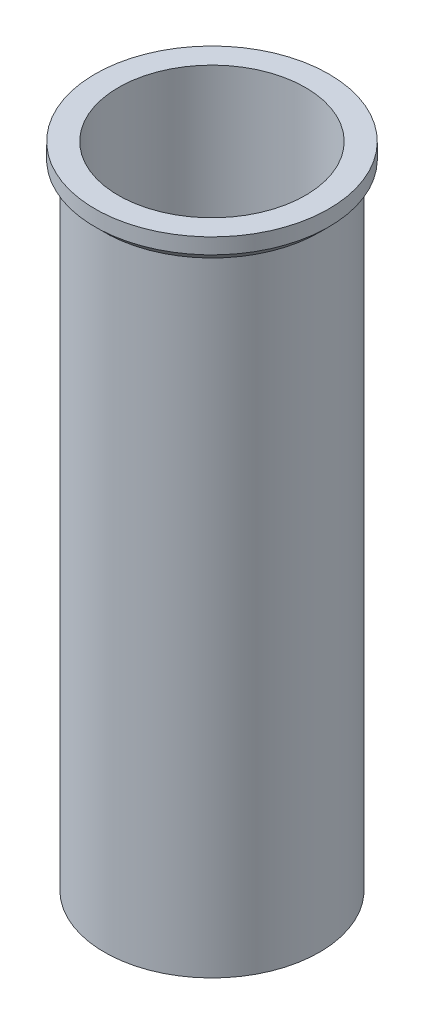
ISO-10303-21;
HEADER;
FILE_DESCRIPTION(('STEP AP214'),'2;1');
FILE_NAME('part.step','',(''),(''),'','','');
FILE_SCHEMA(('AUTOMOTIVE_DESIGN { 1 0 10303 214 1 1 1 1 }'));
ENDSEC;
DATA;
#1=APPLICATION_CONTEXT('core data for automotive mechanical design processes');
#2=APPLICATION_PROTOCOL_DEFINITION('international standard','automotive_design',2000,#1);
#3=PRODUCT_CONTEXT('',#1,'mechanical');
#4=PRODUCT('Part','Part','',(#3));
#5=PRODUCT_RELATED_PRODUCT_CATEGORY('part','',(#4));
#6=PRODUCT_DEFINITION_FORMATION('','',#4);
#7=PRODUCT_DEFINITION_CONTEXT('part definition',#1,'design');
#8=PRODUCT_DEFINITION('design','',#6,#7);
#9=PRODUCT_DEFINITION_SHAPE('','',#8);
#10=(LENGTH_UNIT() NAMED_UNIT(*) SI_UNIT(.MILLI.,.METRE.));
#11=(NAMED_UNIT(*) PLANE_ANGLE_UNIT() SI_UNIT($,.RADIAN.));
#12=(NAMED_UNIT(*) SI_UNIT($,.STERADIAN.) SOLID_ANGLE_UNIT());
#13=UNCERTAINTY_MEASURE_WITH_UNIT(LENGTH_MEASURE(1.E-05),#10,'distance_accuracy_value','');
#14=(GEOMETRIC_REPRESENTATION_CONTEXT(3) GLOBAL_UNCERTAINTY_ASSIGNED_CONTEXT((#13)) GLOBAL_UNIT_ASSIGNED_CONTEXT((#10,
#11,#12)) REPRESENTATION_CONTEXT('',''));
#15=CARTESIAN_POINT('',(0.,0.,0.));
#16=DIRECTION('',(0.,0.,1.));
#17=DIRECTION('',(1.,0.,0.));
#18=AXIS2_PLACEMENT_3D('',#15,#16,#17);
#19=CARTESIAN_POINT('',(0.,0.,0.));
#20=DIRECTION('',(0.,1.,0.));
#21=DIRECTION('',(0.,0.,1.));
#22=AXIS2_PLACEMENT_3D('',#19,#20,#21);
#23=PLANE('',#22);
#24=CARTESIAN_POINT('',(0.,0.,0.));
#25=DIRECTION('',(0.,-1.,0.));
#26=DIRECTION('',(0.,0.,-1.));
#27=AXIS2_PLACEMENT_3D('',#24,#25,#26);
#28=CIRCLE('',#27,6.9);
#29=CARTESIAN_POINT('',(0.,0.,-6.9));
#30=VERTEX_POINT('',#29);
#31=EDGE_CURVE('E10',#30,#30,#28,.T.);
#32=ORIENTED_EDGE('',*,*,#31,.T.);
#33=EDGE_LOOP('',(#32));
#34=FACE_BOUND('',#33,.T.);
#35=ADVANCED_FACE('F33',(#34),#23,.F.);
#36=CARTESIAN_POINT('',(0.,0.,0.));
#37=DIRECTION('',(0.,-1.,0.));
#38=DIRECTION('',(0.,0.,-1.));
#39=AXIS2_PLACEMENT_3D('',#36,#37,#38);
#40=CYLINDRICAL_SURFACE('',#39,6.9);
#41=ORIENTED_EDGE('',*,*,#31,.F.);
#42=EDGE_LOOP('',(#41));
#43=FACE_BOUND('',#42,.T.);
#44=CARTESIAN_POINT('',(0.,40.,0.));
#45=DIRECTION('',(0.,-1.,0.));
#46=DIRECTION('',(0.,0.,-1.));
#47=AXIS2_PLACEMENT_3D('',#44,#45,#46);
#48=CIRCLE('',#47,6.9);
#49=CARTESIAN_POINT('',(0.,40.,-6.9));
#50=VERTEX_POINT('',#49);
#51=EDGE_CURVE('E39',#50,#50,#48,.T.);
#52=ORIENTED_EDGE('',*,*,#51,.T.);
#53=EDGE_LOOP('',(#52));
#54=FACE_BOUND('',#53,.T.);
#55=ADVANCED_FACE('F71',(#43,#54),#40,.T.);
#56=CARTESIAN_POINT('',(0.,40.6,0.));
#57=DIRECTION('',(0.,1.,0.));
#58=DIRECTION('',(0.,0.,1.));
#59=AXIS2_PLACEMENT_3D('',#56,#57,#58);
#60=CONICAL_SURFACE('',#59,7.5,0.78539816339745);
#61=ORIENTED_EDGE('',*,*,#51,.F.);
#62=EDGE_LOOP('',(#61));
#63=FACE_BOUND('',#62,.T.);
#64=CARTESIAN_POINT('',(0.,40.6,0.));
#65=DIRECTION('',(0.,-1.,0.));
#66=DIRECTION('',(0.,0.,-1.));
#67=AXIS2_PLACEMENT_3D('',#64,#65,#66);
#68=CIRCLE('',#67,7.5);
#69=CARTESIAN_POINT('',(0.,40.6,-7.5));
#70=VERTEX_POINT('',#69);
#71=EDGE_CURVE('E43',#70,#70,#68,.T.);
#72=ORIENTED_EDGE('',*,*,#71,.T.);
#73=EDGE_LOOP('',(#72));
#74=FACE_BOUND('',#73,.T.);
#75=ADVANCED_FACE('F75',(#63,#74),#60,.T.);
#76=CARTESIAN_POINT('',(0.,0.,0.));
#77=DIRECTION('',(0.,-1.,0.));
#78=DIRECTION('',(0.,0.,-1.));
#79=AXIS2_PLACEMENT_3D('',#76,#77,#78);
#80=CYLINDRICAL_SURFACE('',#79,7.5);
#81=ORIENTED_EDGE('',*,*,#71,.F.);
#82=EDGE_LOOP('',(#81));
#83=FACE_BOUND('',#82,.T.);
#84=CARTESIAN_POINT('',(0.,41.6,0.));
#85=DIRECTION('',(0.,-1.,0.));
#86=DIRECTION('',(0.,0.,-1.));
#87=AXIS2_PLACEMENT_3D('',#84,#85,#86);
#88=CIRCLE('',#87,7.5);
#89=CARTESIAN_POINT('',(0.,41.6,-7.5));
#90=VERTEX_POINT('',#89);
#91=EDGE_CURVE('E47',#90,#90,#88,.T.);
#92=ORIENTED_EDGE('',*,*,#91,.T.);
#93=EDGE_LOOP('',(#92));
#94=FACE_BOUND('',#93,.T.);
#95=ADVANCED_FACE('F80',(#83,#94),#80,.T.);
#96=CARTESIAN_POINT('',(-7.5,41.6,0.));
#97=DIRECTION('',(0.,-1.,0.));
#98=DIRECTION('',(0.,0.,-1.));
#99=AXIS2_PLACEMENT_3D('',#96,#97,#98);
#100=PLANE('',#99);
#101=ORIENTED_EDGE('',*,*,#91,.F.);
#102=EDGE_LOOP('',(#101));
#103=FACE_BOUND('',#102,.T.);
#104=CARTESIAN_POINT('',(0.,41.6,0.));
#105=DIRECTION('',(0.,-1.,0.));
#106=DIRECTION('',(0.,0.,-1.));
#107=AXIS2_PLACEMENT_3D('',#104,#105,#106);
#108=CIRCLE('',#107,6.);
#109=CARTESIAN_POINT('',(0.,41.6,-6.));
#110=VERTEX_POINT('',#109);
#111=EDGE_CURVE('E52',#110,#110,#108,.T.);
#112=ORIENTED_EDGE('',*,*,#111,.T.);
#113=EDGE_LOOP('',(#112));
#114=FACE_BOUND('',#113,.T.);
#115=ADVANCED_FACE('F67',(#103,#114),#100,.F.);
#116=CARTESIAN_POINT('',(0.,0.,0.));
#117=DIRECTION('',(0.,-1.,0.));
#118=DIRECTION('',(0.,0.,-1.));
#119=AXIS2_PLACEMENT_3D('',#116,#117,#118);
#120=CYLINDRICAL_SURFACE('',#119,6.);
#121=ORIENTED_EDGE('',*,*,#111,.F.);
#122=EDGE_LOOP('',(#121));
#123=FACE_BOUND('',#122,.T.);
#124=CARTESIAN_POINT('',(0.,0.999999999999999,0.));
#125=DIRECTION('',(0.,-1.,0.));
#126=DIRECTION('',(0.,0.,-1.));
#127=AXIS2_PLACEMENT_3D('',#124,#125,#126);
#128=CIRCLE('',#127,6.);
#129=CARTESIAN_POINT('',(0.,0.999999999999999,-6.));
#130=VERTEX_POINT('',#129);
#131=EDGE_CURVE('E55',#130,#130,#128,.T.);
#132=ORIENTED_EDGE('',*,*,#131,.T.);
#133=EDGE_LOOP('',(#132));
#134=FACE_BOUND('',#133,.T.);
#135=ADVANCED_FACE('F59',(#123,#134),#120,.F.);
#136=CARTESIAN_POINT('',(-6.,0.999999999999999,0.));
#137=DIRECTION('',(0.,-1.,0.));
#138=DIRECTION('',(0.,0.,-1.));
#139=AXIS2_PLACEMENT_3D('',#136,#137,#138);
#140=PLANE('',#139);
#141=ORIENTED_EDGE('',*,*,#131,.F.);
#142=EDGE_LOOP('',(#141));
#143=FACE_BOUND('',#142,.T.);
#144=ADVANCED_FACE('F61',(#143),#140,.F.);
#145=CLOSED_SHELL('',(#35,#55,#75,#95,#115,#135,#144));
#146=MANIFOLD_SOLID_BREP('B2',#145);
#147=ADVANCED_BREP_SHAPE_REPRESENTATION('',(#18,#146),#14);
#148=SHAPE_DEFINITION_REPRESENTATION(#9,#147);
ENDSEC;
END-ISO-10303-21;
